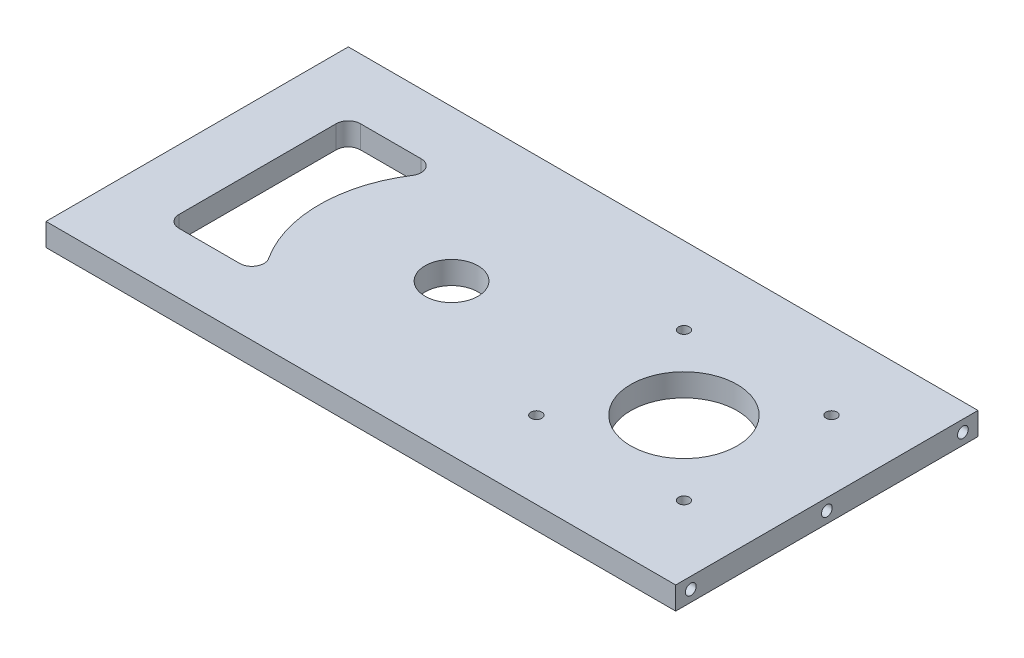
from build123d import *

# Parameters (mm, degrees)
SKETCH1_W           = 132.2705
SKETCH1_H           = 63.5
BOSS_EXTRUDE1_DEPTH = 4.7625
SKETCH2_R           = 1.1303
CUT_EXTRUDE1_DEPTH  = 10.16
SKETCH3_R           = 5.55625
CUT_EXTRUDE2_DEPTH  = 74.516088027
SKETCH4_R           = 11.176
SKETCH4_R_2         = 1.143
CUT_EXTRUDE3_DEPTH  = 74.516088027
CUT_EXTRUDE4_DEPTH  = 74.516088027
FILLET1_R           = 2.54


with BuildPart() as part:
    # Sketch1 → Boss-Extrude1 (new body)
    with BuildSketch(Plane(origin=(0, 0, 0), x_dir=(1, 0, 0), z_dir=(0, 1, 0))):
        Rectangle(SKETCH1_W, SKETCH1_H)
    extrude(amount=BOSS_EXTRUDE1_DEPTH)

    # Sketch2 → Cut-Extrude1 (cut)
    with BuildSketch(Plane.ZY.offset(66.13525)):
        with Locations((-28.575, 2.38125)):
            Circle(SKETCH2_R)
        with Locations(Location((28.575, 2.38125, 0), (0, 0, 180))):
            Circle(SKETCH2_R)
        with Locations((0, 2.38125)):
            Circle(SKETCH2_R)
    cut_extrude1 = extrude(amount=-CUT_EXTRUDE1_DEPTH, mode=Mode.SUBTRACT)

    # Mirror1: Cut-Extrude1 across plane
    add(cut_extrude1.mirror(Plane(origin=(0, 0, 0), x_dir=(0, 0, 1), z_dir=(1, 0, 0))), mode=Mode.SUBTRACT)

    # Sketch3 → Cut-Extrude2 (cut, through all)
    with BuildSketch(Plane(origin=(0, 4.7625, 0), x_dir=(1, 0, 0), z_dir=(0, 1, 0))):
        with Locations(Location((-12.7, 0, 0), (0, 0, 270))):
            Circle(SKETCH3_R)
    extrude(amount=-CUT_EXTRUDE2_DEPTH, mode=Mode.SUBTRACT)

    # Sketch4 → Cut-Extrude3 (cut, through all)
    with BuildSketch(Plane(origin=(0, 4.7625, 0), x_dir=(1, 0, 0), z_dir=(0, 1, 0))):
        with Locations(Location((36.11626, 0, 0), (0, 0, 270))):
            Circle(SKETCH4_R)
        with Locations(Location((20.61626, 15.5, 0), (0, 0, 270))):
            Circle(SKETCH4_R_2)
        with Locations(Location((51.61626, 15.5, 0), (0, 0, 270))):
            Circle(SKETCH4_R_2)
        with Locations(Location((51.61626, -15.5, 0), (0, 0, 270))):
            Circle(SKETCH4_R_2)
        with Locations(Location((20.61626, -15.5, 0), (0, 0, 270))):
            Circle(SKETCH4_R_2)
    extrude(amount=-CUT_EXTRUDE3_DEPTH, mode=Mode.SUBTRACT)

    # Sketch5 → Cut-Extrude4 (cut, through all)
    with BuildSketch(Plane(origin=(0, 4.7625, 0), x_dir=(1, 0, 0), z_dir=(0, 1, 0))):
        with BuildLine():
            Line((-53.43525, 19.05), (-53.43525, -19.05))
            Line((-53.43525, -19.05), (-32.921160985, -19.05))
            ThreePointArc((-32.921160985, -19.05), (-40.48125, 0), (-32.921160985, 19.05))
            Line((-32.921160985, 19.05), (-53.43525, 19.05))
        make_face()
    extrude(amount=-CUT_EXTRUDE4_DEPTH, mode=Mode.SUBTRACT)

    # Fillet1
    fillet1_edges = [part.edges().sort_by_distance(p)[0] for p in [
        (-53.43525, 2.38125, -19.05),
        (-32.921160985, 2.38125, -19.05),
        (-32.921160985, 2.38125, 19.05),
        (-53.43525, 2.38125, 19.05),
    ]]
    fillet(fillet1_edges, radius=FILLET1_R)


solid = part.part
